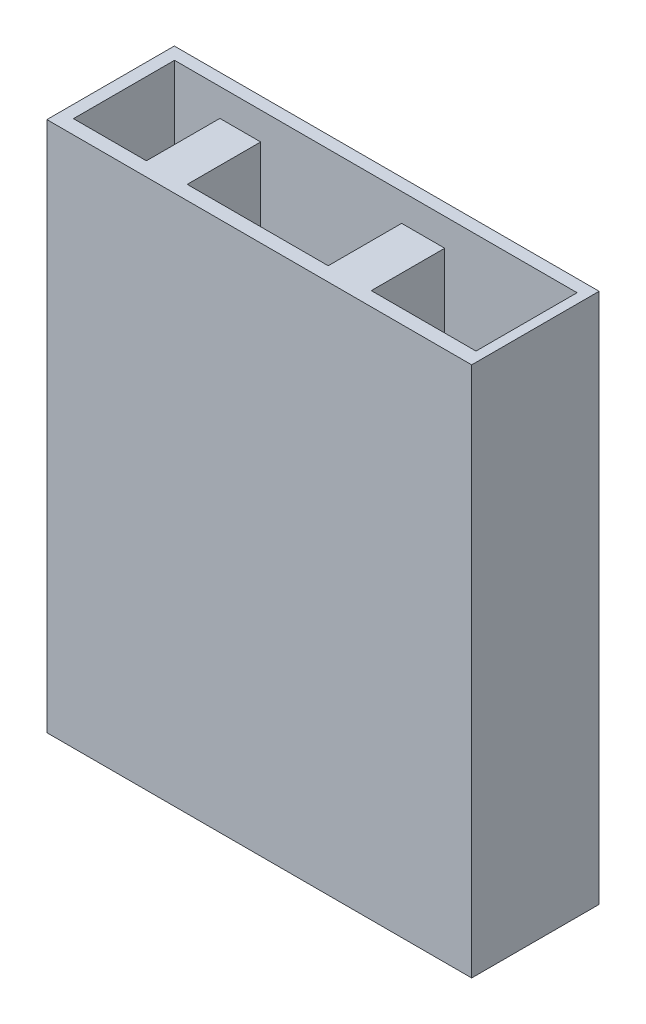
ISO-10303-21;
HEADER;
FILE_DESCRIPTION(('STEP AP214'),'2;1');
FILE_NAME('part.step','',(''),(''),'','','');
FILE_SCHEMA(('AUTOMOTIVE_DESIGN { 1 0 10303 214 1 1 1 1 }'));
ENDSEC;
DATA;
#1=APPLICATION_CONTEXT('core data for automotive mechanical design processes');
#2=APPLICATION_PROTOCOL_DEFINITION('international standard','automotive_design',2000,#1);
#3=PRODUCT_CONTEXT('',#1,'mechanical');
#4=PRODUCT('Part','Part','',(#3));
#5=PRODUCT_RELATED_PRODUCT_CATEGORY('part','',(#4));
#6=PRODUCT_DEFINITION_FORMATION('','',#4);
#7=PRODUCT_DEFINITION_CONTEXT('part definition',#1,'design');
#8=PRODUCT_DEFINITION('design','',#6,#7);
#9=PRODUCT_DEFINITION_SHAPE('','',#8);
#10=(LENGTH_UNIT() NAMED_UNIT(*) SI_UNIT(.MILLI.,.METRE.));
#11=(NAMED_UNIT(*) PLANE_ANGLE_UNIT() SI_UNIT($,.RADIAN.));
#12=(NAMED_UNIT(*) SI_UNIT($,.STERADIAN.) SOLID_ANGLE_UNIT());
#13=UNCERTAINTY_MEASURE_WITH_UNIT(LENGTH_MEASURE(1.E-05),#10,'distance_accuracy_value','');
#14=(GEOMETRIC_REPRESENTATION_CONTEXT(3) GLOBAL_UNCERTAINTY_ASSIGNED_CONTEXT((#13)) GLOBAL_UNIT_ASSIGNED_CONTEXT((#10,
#11,#12)) REPRESENTATION_CONTEXT('',''));
#15=CARTESIAN_POINT('',(0.,0.,0.));
#16=DIRECTION('',(0.,0.,1.));
#17=DIRECTION('',(1.,0.,0.));
#18=AXIS2_PLACEMENT_3D('',#15,#16,#17);
#19=CARTESIAN_POINT('',(0.,5.,0.));
#20=DIRECTION('',(1.,0.,0.));
#21=DIRECTION('',(0.,0.,-1.));
#22=AXIS2_PLACEMENT_3D('',#19,#20,#21);
#23=PLANE('',#22);
#24=DIRECTION('',(0.,0.,1.));
#25=VECTOR('',#24,1.);
#26=CARTESIAN_POINT('',(0.,0.,0.));
#27=LINE('',#26,#25);
#28=CARTESIAN_POINT('',(0.,0.,0.));
#29=VERTEX_POINT('',#28);
#30=CARTESIAN_POINT('',(0.,0.,1.2));
#31=VERTEX_POINT('',#30);
#32=EDGE_CURVE('E226',#29,#31,#27,.T.);
#33=ORIENTED_EDGE('',*,*,#32,.T.);
#34=DIRECTION('',(0.,-1.,0.));
#35=VECTOR('',#34,1.);
#36=CARTESIAN_POINT('',(0.,5.,1.2));
#37=LINE('',#36,#35);
#38=CARTESIAN_POINT('',(0.,5.,1.2));
#39=VERTEX_POINT('',#38);
#40=EDGE_CURVE('E11',#39,#31,#37,.T.);
#41=ORIENTED_EDGE('',*,*,#40,.F.);
#42=DIRECTION('',(0.,0.,1.));
#43=VECTOR('',#42,1.);
#44=CARTESIAN_POINT('',(0.,5.,0.));
#45=LINE('',#44,#43);
#46=CARTESIAN_POINT('',(0.,5.,0.));
#47=VERTEX_POINT('',#46);
#48=EDGE_CURVE('E246',#47,#39,#45,.T.);
#49=ORIENTED_EDGE('',*,*,#48,.F.);
#50=DIRECTION('',(0.,-1.,0.));
#51=VECTOR('',#50,1.);
#52=CARTESIAN_POINT('',(0.,5.,0.));
#53=LINE('',#52,#51);
#54=EDGE_CURVE('E256',#47,#29,#53,.T.);
#55=ORIENTED_EDGE('',*,*,#54,.T.);
#56=EDGE_LOOP('',(#33,#41,#49,#55));
#57=FACE_BOUND('',#56,.T.);
#58=ADVANCED_FACE('F33',(#57),#23,.F.);
#59=CARTESIAN_POINT('',(0.,5.,1.2));
#60=DIRECTION('',(0.,0.,-1.));
#61=DIRECTION('',(-1.,0.,0.));
#62=AXIS2_PLACEMENT_3D('',#59,#60,#61);
#63=PLANE('',#62);
#64=DIRECTION('',(1.,0.,0.));
#65=VECTOR('',#64,1.);
#66=CARTESIAN_POINT('',(0.,0.,1.2));
#67=LINE('',#66,#65);
#68=CARTESIAN_POINT('',(4.,0.,1.2));
#69=VERTEX_POINT('',#68);
#70=EDGE_CURVE('E259',#31,#69,#67,.T.);
#71=ORIENTED_EDGE('',*,*,#70,.T.);
#72=DIRECTION('',(0.,-1.,0.));
#73=VECTOR('',#72,1.);
#74=CARTESIAN_POINT('',(4.,5.,1.2));
#75=LINE('',#74,#73);
#76=CARTESIAN_POINT('',(4.,5.,1.2));
#77=VERTEX_POINT('',#76);
#78=EDGE_CURVE('E40',#77,#69,#75,.T.);
#79=ORIENTED_EDGE('',*,*,#78,.F.);
#80=DIRECTION('',(1.,0.,0.));
#81=VECTOR('',#80,1.);
#82=CARTESIAN_POINT('',(0.,5.,1.2));
#83=LINE('',#82,#81);
#84=EDGE_CURVE('E249',#39,#77,#83,.T.);
#85=ORIENTED_EDGE('',*,*,#84,.F.);
#86=ORIENTED_EDGE('',*,*,#40,.T.);
#87=EDGE_LOOP('',(#71,#79,#85,#86));
#88=FACE_BOUND('',#87,.T.);
#89=ADVANCED_FACE('F287',(#88),#63,.F.);
#90=CARTESIAN_POINT('',(4.,5.,0.));
#91=DIRECTION('',(-1.,0.,0.));
#92=DIRECTION('',(0.,0.,1.));
#93=AXIS2_PLACEMENT_3D('',#90,#91,#92);
#94=PLANE('',#93);
#95=DIRECTION('',(0.,0.,-1.));
#96=VECTOR('',#95,1.);
#97=CARTESIAN_POINT('',(4.,0.,0.));
#98=LINE('',#97,#96);
#99=CARTESIAN_POINT('',(4.,0.,0.));
#100=VERTEX_POINT('',#99);
#101=EDGE_CURVE('E261',#69,#100,#98,.T.);
#102=ORIENTED_EDGE('',*,*,#101,.T.);
#103=DIRECTION('',(0.,-1.,0.));
#104=VECTOR('',#103,1.);
#105=CARTESIAN_POINT('',(4.,5.,0.));
#106=LINE('',#105,#104);
#107=CARTESIAN_POINT('',(4.,5.,0.));
#108=VERTEX_POINT('',#107);
#109=EDGE_CURVE('E266',#108,#100,#106,.T.);
#110=ORIENTED_EDGE('',*,*,#109,.F.);
#111=DIRECTION('',(0.,0.,-1.));
#112=VECTOR('',#111,1.);
#113=CARTESIAN_POINT('',(4.,5.,0.));
#114=LINE('',#113,#112);
#115=EDGE_CURVE('E252',#77,#108,#114,.T.);
#116=ORIENTED_EDGE('',*,*,#115,.F.);
#117=ORIENTED_EDGE('',*,*,#78,.T.);
#118=EDGE_LOOP('',(#102,#110,#116,#117));
#119=FACE_BOUND('',#118,.T.);
#120=ADVANCED_FACE('F273',(#119),#94,.F.);
#121=CARTESIAN_POINT('',(0.,5.,0.));
#122=DIRECTION('',(0.,0.,1.));
#123=DIRECTION('',(1.,0.,0.));
#124=AXIS2_PLACEMENT_3D('',#121,#122,#123);
#125=PLANE('',#124);
#126=DIRECTION('',(-1.,0.,0.));
#127=VECTOR('',#126,1.);
#128=CARTESIAN_POINT('',(0.,0.,0.));
#129=LINE('',#128,#127);
#130=EDGE_CURVE('E250',#100,#29,#129,.T.);
#131=ORIENTED_EDGE('',*,*,#130,.T.);
#132=ORIENTED_EDGE('',*,*,#54,.F.);
#133=DIRECTION('',(-1.,0.,0.));
#134=VECTOR('',#133,1.);
#135=CARTESIAN_POINT('',(0.,5.,0.));
#136=LINE('',#135,#134);
#137=EDGE_CURVE('E254',#108,#47,#136,.T.);
#138=ORIENTED_EDGE('',*,*,#137,.F.);
#139=ORIENTED_EDGE('',*,*,#109,.T.);
#140=EDGE_LOOP('',(#131,#132,#138,#139));
#141=FACE_BOUND('',#140,.T.);
#142=ADVANCED_FACE('F280',(#141),#125,.F.);
#143=CARTESIAN_POINT('',(0.,5.,0.));
#144=DIRECTION('',(0.,1.,0.));
#145=DIRECTION('',(0.,0.,1.));
#146=AXIS2_PLACEMENT_3D('',#143,#144,#145);
#147=PLANE('',#146);
#148=DIRECTION('',(0.,0.,1.));
#149=VECTOR('',#148,1.);
#150=CARTESIAN_POINT('',(0.117551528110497,5.,0.115514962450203));
#151=LINE('',#150,#149);
#152=CARTESIAN_POINT('',(0.117551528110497,5.,0.115514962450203));
#153=VERTEX_POINT('',#152);
#154=CARTESIAN_POINT('',(0.117551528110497,5.,1.06741067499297));
#155=VERTEX_POINT('',#154);
#156=EDGE_CURVE('E47',#153,#155,#151,.T.);
#157=ORIENTED_EDGE('',*,*,#156,.F.);
#158=DIRECTION('',(-1.,0.,0.));
#159=VECTOR('',#158,1.);
#160=CARTESIAN_POINT('',(0.117551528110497,5.,0.115514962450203));
#161=LINE('',#160,#159);
#162=CARTESIAN_POINT('',(3.90806001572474,5.,0.115514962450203));
#163=VERTEX_POINT('',#162);
#164=EDGE_CURVE('E164',#163,#153,#161,.T.);
#165=ORIENTED_EDGE('',*,*,#164,.F.);
#166=DIRECTION('',(0.,0.,-1.));
#167=VECTOR('',#166,1.);
#168=CARTESIAN_POINT('',(3.90806001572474,5.,0.115514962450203));
#169=LINE('',#168,#167);
#170=CARTESIAN_POINT('',(3.90806001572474,5.,1.06741067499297));
#171=VERTEX_POINT('',#170);
#172=EDGE_CURVE('E167',#171,#163,#169,.T.);
#173=ORIENTED_EDGE('',*,*,#172,.F.);
#174=DIRECTION('',(1.,0.,0.));
#175=VECTOR('',#174,1.);
#176=CARTESIAN_POINT('',(2.92201557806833,5.,1.06741067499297));
#177=LINE('',#176,#175);
#178=CARTESIAN_POINT('',(2.92201557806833,5.,1.06741067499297));
#179=VERTEX_POINT('',#178);
#180=EDGE_CURVE('E219',#179,#171,#177,.T.);
#181=ORIENTED_EDGE('',*,*,#180,.F.);
#182=DIRECTION('',(0.,0.,1.));
#183=VECTOR('',#182,1.);
#184=CARTESIAN_POINT('',(2.92201557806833,5.,0.375898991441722));
#185=LINE('',#184,#183);
#186=CARTESIAN_POINT('',(2.92201557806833,5.,0.375898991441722));
#187=VERTEX_POINT('',#186);
#188=EDGE_CURVE('E216',#187,#179,#185,.T.);
#189=ORIENTED_EDGE('',*,*,#188,.F.);
#190=DIRECTION('',(1.,0.,0.));
#191=VECTOR('',#190,1.);
#192=CARTESIAN_POINT('',(2.51649946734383,5.,0.375898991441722));
#193=LINE('',#192,#191);
#194=CARTESIAN_POINT('',(2.51649946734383,5.,0.375898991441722));
#195=VERTEX_POINT('',#194);
#196=EDGE_CURVE('E213',#195,#187,#193,.T.);
#197=ORIENTED_EDGE('',*,*,#196,.F.);
#198=DIRECTION('',(0.,0.,-1.));
#199=VECTOR('',#198,1.);
#200=CARTESIAN_POINT('',(2.51649946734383,5.,0.375898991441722));
#201=LINE('',#200,#199);
#202=CARTESIAN_POINT('',(2.51649946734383,5.,1.06741067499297));
#203=VERTEX_POINT('',#202);
#204=EDGE_CURVE('E210',#203,#195,#201,.T.);
#205=ORIENTED_EDGE('',*,*,#204,.F.);
#206=DIRECTION('',(1.,0.,0.));
#207=VECTOR('',#206,1.);
#208=CARTESIAN_POINT('',(1.18896777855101,5.,1.06741067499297));
#209=LINE('',#208,#207);
#210=CARTESIAN_POINT('',(1.18896777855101,5.,1.06741067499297));
#211=VERTEX_POINT('',#210);
#212=EDGE_CURVE('E207',#211,#203,#209,.T.);
#213=ORIENTED_EDGE('',*,*,#212,.F.);
#214=DIRECTION('',(0.,0.,1.));
#215=VECTOR('',#214,1.);
#216=CARTESIAN_POINT('',(1.18896777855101,5.,0.375898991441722));
#217=LINE('',#216,#215);
#218=CARTESIAN_POINT('',(1.18896777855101,5.,0.375898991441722));
#219=VERTEX_POINT('',#218);
#220=EDGE_CURVE('E204',#219,#211,#217,.T.);
#221=ORIENTED_EDGE('',*,*,#220,.F.);
#222=DIRECTION('',(1.,0.,0.));
#223=VECTOR('',#222,1.);
#224=CARTESIAN_POINT('',(0.804794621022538,5.,0.375898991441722));
#225=LINE('',#224,#223);
#226=CARTESIAN_POINT('',(0.804794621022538,5.,0.375898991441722));
#227=VERTEX_POINT('',#226);
#228=EDGE_CURVE('E201',#227,#219,#225,.T.);
#229=ORIENTED_EDGE('',*,*,#228,.F.);
#230=DIRECTION('',(0.,0.,-1.));
#231=VECTOR('',#230,1.);
#232=CARTESIAN_POINT('',(0.804794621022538,5.,0.375898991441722));
#233=LINE('',#232,#231);
#234=CARTESIAN_POINT('',(0.804794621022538,5.,1.06741067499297));
#235=VERTEX_POINT('',#234);
#236=EDGE_CURVE('E198',#235,#227,#233,.T.);
#237=ORIENTED_EDGE('',*,*,#236,.F.);
#238=DIRECTION('',(1.,0.,0.));
#239=VECTOR('',#238,1.);
#240=CARTESIAN_POINT('',(0.117551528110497,5.,1.06741067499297));
#241=LINE('',#240,#239);
#242=EDGE_CURVE('E196',#155,#235,#241,.T.);
#243=ORIENTED_EDGE('',*,*,#242,.F.);
#244=EDGE_LOOP('',(#157,#165,#173,#181,#189,#197,#205,#213,#221,#229,#237,#243));
#245=FACE_BOUND('',#244,.T.);
#246=ORIENTED_EDGE('',*,*,#48,.T.);
#247=ORIENTED_EDGE('',*,*,#84,.T.);
#248=ORIENTED_EDGE('',*,*,#115,.T.);
#249=ORIENTED_EDGE('',*,*,#137,.T.);
#250=EDGE_LOOP('',(#246,#247,#248,#249));
#251=FACE_BOUND('',#250,.T.);
#252=ADVANCED_FACE('F286',(#245,#251),#147,.T.);
#253=CARTESIAN_POINT('',(0.,0.,0.));
#254=DIRECTION('',(0.,1.,0.));
#255=DIRECTION('',(0.,0.,1.));
#256=AXIS2_PLACEMENT_3D('',#253,#254,#255);
#257=PLANE('',#256);
#258=DIRECTION('',(-1.,0.,0.));
#259=VECTOR('',#258,1.);
#260=CARTESIAN_POINT('',(0.117551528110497,0.,0.115514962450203));
#261=LINE('',#260,#259);
#262=CARTESIAN_POINT('',(3.90806001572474,0.,0.115514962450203));
#263=VERTEX_POINT('',#262);
#264=CARTESIAN_POINT('',(0.117551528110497,0.,0.115514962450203));
#265=VERTEX_POINT('',#264);
#266=EDGE_CURVE('E153',#263,#265,#261,.T.);
#267=ORIENTED_EDGE('',*,*,#266,.T.);
#268=DIRECTION('',(0.,0.,1.));
#269=VECTOR('',#268,1.);
#270=CARTESIAN_POINT('',(0.117551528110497,0.,0.115514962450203));
#271=LINE('',#270,#269);
#272=CARTESIAN_POINT('',(0.117551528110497,0.,1.06741067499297));
#273=VERTEX_POINT('',#272);
#274=EDGE_CURVE('E147',#265,#273,#271,.T.);
#275=ORIENTED_EDGE('',*,*,#274,.T.);
#276=DIRECTION('',(1.,0.,0.));
#277=VECTOR('',#276,1.);
#278=CARTESIAN_POINT('',(0.117551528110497,0.,1.06741067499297));
#279=LINE('',#278,#277);
#280=CARTESIAN_POINT('',(0.804794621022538,0.,1.06741067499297));
#281=VERTEX_POINT('',#280);
#282=EDGE_CURVE('E156',#273,#281,#279,.T.);
#283=ORIENTED_EDGE('',*,*,#282,.T.);
#284=DIRECTION('',(0.,0.,-1.));
#285=VECTOR('',#284,1.);
#286=CARTESIAN_POINT('',(0.804794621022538,0.,0.375898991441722));
#287=LINE('',#286,#285);
#288=CARTESIAN_POINT('',(0.804794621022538,0.,0.375898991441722));
#289=VERTEX_POINT('',#288);
#290=EDGE_CURVE('E55',#281,#289,#287,.T.);
#291=ORIENTED_EDGE('',*,*,#290,.T.);
#292=DIRECTION('',(1.,0.,0.));
#293=VECTOR('',#292,1.);
#294=CARTESIAN_POINT('',(0.804794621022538,0.,0.375898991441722));
#295=LINE('',#294,#293);
#296=CARTESIAN_POINT('',(1.18896777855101,0.,0.375898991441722));
#297=VERTEX_POINT('',#296);
#298=EDGE_CURVE('E171',#289,#297,#295,.T.);
#299=ORIENTED_EDGE('',*,*,#298,.T.);
#300=DIRECTION('',(0.,0.,1.));
#301=VECTOR('',#300,1.);
#302=CARTESIAN_POINT('',(1.18896777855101,0.,0.375898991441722));
#303=LINE('',#302,#301);
#304=CARTESIAN_POINT('',(1.18896777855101,0.,1.06741067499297));
#305=VERTEX_POINT('',#304);
#306=EDGE_CURVE('E174',#297,#305,#303,.T.);
#307=ORIENTED_EDGE('',*,*,#306,.T.);
#308=DIRECTION('',(1.,0.,0.));
#309=VECTOR('',#308,1.);
#310=CARTESIAN_POINT('',(1.18896777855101,0.,1.06741067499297));
#311=LINE('',#310,#309);
#312=CARTESIAN_POINT('',(2.51649946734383,0.,1.06741067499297));
#313=VERTEX_POINT('',#312);
#314=EDGE_CURVE('E177',#305,#313,#311,.T.);
#315=ORIENTED_EDGE('',*,*,#314,.T.);
#316=DIRECTION('',(0.,0.,-1.));
#317=VECTOR('',#316,1.);
#318=CARTESIAN_POINT('',(2.51649946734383,0.,0.375898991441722));
#319=LINE('',#318,#317);
#320=CARTESIAN_POINT('',(2.51649946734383,0.,0.375898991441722));
#321=VERTEX_POINT('',#320);
#322=EDGE_CURVE('E180',#313,#321,#319,.T.);
#323=ORIENTED_EDGE('',*,*,#322,.T.);
#324=DIRECTION('',(1.,0.,0.));
#325=VECTOR('',#324,1.);
#326=CARTESIAN_POINT('',(2.51649946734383,0.,0.375898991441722));
#327=LINE('',#326,#325);
#328=CARTESIAN_POINT('',(2.92201557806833,0.,0.375898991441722));
#329=VERTEX_POINT('',#328);
#330=EDGE_CURVE('E183',#321,#329,#327,.T.);
#331=ORIENTED_EDGE('',*,*,#330,.T.);
#332=DIRECTION('',(0.,0.,1.));
#333=VECTOR('',#332,1.);
#334=CARTESIAN_POINT('',(2.92201557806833,0.,0.375898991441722));
#335=LINE('',#334,#333);
#336=CARTESIAN_POINT('',(2.92201557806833,0.,1.06741067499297));
#337=VERTEX_POINT('',#336);
#338=EDGE_CURVE('E186',#329,#337,#335,.T.);
#339=ORIENTED_EDGE('',*,*,#338,.T.);
#340=DIRECTION('',(1.,0.,0.));
#341=VECTOR('',#340,1.);
#342=CARTESIAN_POINT('',(2.92201557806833,0.,1.06741067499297));
#343=LINE('',#342,#341);
#344=CARTESIAN_POINT('',(3.90806001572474,0.,1.06741067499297));
#345=VERTEX_POINT('',#344);
#346=EDGE_CURVE('E189',#337,#345,#343,.T.);
#347=ORIENTED_EDGE('',*,*,#346,.T.);
#348=DIRECTION('',(0.,0.,-1.));
#349=VECTOR('',#348,1.);
#350=CARTESIAN_POINT('',(3.90806001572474,0.,0.115514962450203));
#351=LINE('',#350,#349);
#352=EDGE_CURVE('E192',#345,#263,#351,.T.);
#353=ORIENTED_EDGE('',*,*,#352,.T.);
#354=EDGE_LOOP('',(#267,#275,#283,#291,#299,#307,#315,#323,#331,#339,#347,#353));
#355=FACE_BOUND('',#354,.T.);
#356=ORIENTED_EDGE('',*,*,#32,.F.);
#357=ORIENTED_EDGE('',*,*,#130,.F.);
#358=ORIENTED_EDGE('',*,*,#101,.F.);
#359=ORIENTED_EDGE('',*,*,#70,.F.);
#360=EDGE_LOOP('',(#356,#357,#358,#359));
#361=FACE_BOUND('',#360,.T.);
#362=ADVANCED_FACE('F160',(#355,#361),#257,.F.);
#363=CARTESIAN_POINT('',(0.117551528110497,0.,0.115514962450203));
#364=DIRECTION('',(-1.,0.,0.));
#365=DIRECTION('',(0.,0.,1.));
#366=AXIS2_PLACEMENT_3D('',#363,#364,#365);
#367=PLANE('',#366);
#368=ORIENTED_EDGE('',*,*,#156,.T.);
#369=DIRECTION('',(0.,1.,0.));
#370=VECTOR('',#369,1.);
#371=CARTESIAN_POINT('',(0.117551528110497,0.,1.06741067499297));
#372=LINE('',#371,#370);
#373=EDGE_CURVE('E143',#273,#155,#372,.T.);
#374=ORIENTED_EDGE('',*,*,#373,.F.);
#375=ORIENTED_EDGE('',*,*,#274,.F.);
#376=DIRECTION('',(0.,1.,0.));
#377=VECTOR('',#376,1.);
#378=CARTESIAN_POINT('',(0.117551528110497,0.,0.115514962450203));
#379=LINE('',#378,#377);
#380=EDGE_CURVE('E224',#265,#153,#379,.T.);
#381=ORIENTED_EDGE('',*,*,#380,.T.);
#382=EDGE_LOOP('',(#368,#374,#375,#381));
#383=FACE_BOUND('',#382,.T.);
#384=ADVANCED_FACE('F145',(#383),#367,.F.);
#385=CARTESIAN_POINT('',(0.117551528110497,0.,0.115514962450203));
#386=DIRECTION('',(0.,0.,-1.));
#387=DIRECTION('',(-1.,0.,0.));
#388=AXIS2_PLACEMENT_3D('',#385,#386,#387);
#389=PLANE('',#388);
#390=ORIENTED_EDGE('',*,*,#164,.T.);
#391=ORIENTED_EDGE('',*,*,#380,.F.);
#392=ORIENTED_EDGE('',*,*,#266,.F.);
#393=DIRECTION('',(0.,1.,0.));
#394=VECTOR('',#393,1.);
#395=CARTESIAN_POINT('',(3.90806001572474,0.,0.115514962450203));
#396=LINE('',#395,#394);
#397=EDGE_CURVE('E227',#263,#163,#396,.T.);
#398=ORIENTED_EDGE('',*,*,#397,.T.);
#399=EDGE_LOOP('',(#390,#391,#392,#398));
#400=FACE_BOUND('',#399,.T.);
#401=ADVANCED_FACE('F304',(#400),#389,.F.);
#402=CARTESIAN_POINT('',(3.90806001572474,0.,0.115514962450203));
#403=DIRECTION('',(1.,0.,0.));
#404=DIRECTION('',(0.,0.,-1.));
#405=AXIS2_PLACEMENT_3D('',#402,#403,#404);
#406=PLANE('',#405);
#407=ORIENTED_EDGE('',*,*,#172,.T.);
#408=ORIENTED_EDGE('',*,*,#397,.F.);
#409=ORIENTED_EDGE('',*,*,#352,.F.);
#410=DIRECTION('',(0.,1.,0.));
#411=VECTOR('',#410,1.);
#412=CARTESIAN_POINT('',(3.90806001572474,0.,1.06741067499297));
#413=LINE('',#412,#411);
#414=EDGE_CURVE('E229',#345,#171,#413,.T.);
#415=ORIENTED_EDGE('',*,*,#414,.T.);
#416=EDGE_LOOP('',(#407,#408,#409,#415));
#417=FACE_BOUND('',#416,.T.);
#418=ADVANCED_FACE('F337',(#417),#406,.F.);
#419=CARTESIAN_POINT('',(2.92201557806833,0.,1.06741067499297));
#420=DIRECTION('',(0.,0.,1.));
#421=DIRECTION('',(1.,0.,0.));
#422=AXIS2_PLACEMENT_3D('',#419,#420,#421);
#423=PLANE('',#422);
#424=ORIENTED_EDGE('',*,*,#180,.T.);
#425=ORIENTED_EDGE('',*,*,#414,.F.);
#426=ORIENTED_EDGE('',*,*,#346,.F.);
#427=DIRECTION('',(0.,1.,0.));
#428=VECTOR('',#427,1.);
#429=CARTESIAN_POINT('',(2.92201557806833,0.,1.06741067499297));
#430=LINE('',#429,#428);
#431=EDGE_CURVE('E231',#337,#179,#430,.T.);
#432=ORIENTED_EDGE('',*,*,#431,.T.);
#433=EDGE_LOOP('',(#424,#425,#426,#432));
#434=FACE_BOUND('',#433,.T.);
#435=ADVANCED_FACE('F333',(#434),#423,.F.);
#436=CARTESIAN_POINT('',(2.92201557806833,0.,0.375898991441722));
#437=DIRECTION('',(-1.,0.,0.));
#438=DIRECTION('',(0.,0.,1.));
#439=AXIS2_PLACEMENT_3D('',#436,#437,#438);
#440=PLANE('',#439);
#441=ORIENTED_EDGE('',*,*,#188,.T.);
#442=ORIENTED_EDGE('',*,*,#431,.F.);
#443=ORIENTED_EDGE('',*,*,#338,.F.);
#444=DIRECTION('',(0.,1.,0.));
#445=VECTOR('',#444,1.);
#446=CARTESIAN_POINT('',(2.92201557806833,0.,0.375898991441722));
#447=LINE('',#446,#445);
#448=EDGE_CURVE('E233',#329,#187,#447,.T.);
#449=ORIENTED_EDGE('',*,*,#448,.T.);
#450=EDGE_LOOP('',(#441,#442,#443,#449));
#451=FACE_BOUND('',#450,.T.);
#452=ADVANCED_FACE('F329',(#451),#440,.F.);
#453=CARTESIAN_POINT('',(2.51649946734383,0.,0.375898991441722));
#454=DIRECTION('',(0.,0.,1.));
#455=DIRECTION('',(1.,0.,0.));
#456=AXIS2_PLACEMENT_3D('',#453,#454,#455);
#457=PLANE('',#456);
#458=ORIENTED_EDGE('',*,*,#196,.T.);
#459=ORIENTED_EDGE('',*,*,#448,.F.);
#460=ORIENTED_EDGE('',*,*,#330,.F.);
#461=DIRECTION('',(0.,1.,0.));
#462=VECTOR('',#461,1.);
#463=CARTESIAN_POINT('',(2.51649946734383,0.,0.375898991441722));
#464=LINE('',#463,#462);
#465=EDGE_CURVE('E235',#321,#195,#464,.T.);
#466=ORIENTED_EDGE('',*,*,#465,.T.);
#467=EDGE_LOOP('',(#458,#459,#460,#466));
#468=FACE_BOUND('',#467,.T.);
#469=ADVANCED_FACE('F325',(#468),#457,.F.);
#470=CARTESIAN_POINT('',(2.51649946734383,0.,0.375898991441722));
#471=DIRECTION('',(1.,0.,0.));
#472=DIRECTION('',(0.,0.,-1.));
#473=AXIS2_PLACEMENT_3D('',#470,#471,#472);
#474=PLANE('',#473);
#475=ORIENTED_EDGE('',*,*,#204,.T.);
#476=ORIENTED_EDGE('',*,*,#465,.F.);
#477=ORIENTED_EDGE('',*,*,#322,.F.);
#478=DIRECTION('',(0.,1.,0.));
#479=VECTOR('',#478,1.);
#480=CARTESIAN_POINT('',(2.51649946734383,0.,1.06741067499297));
#481=LINE('',#480,#479);
#482=EDGE_CURVE('E237',#313,#203,#481,.T.);
#483=ORIENTED_EDGE('',*,*,#482,.T.);
#484=EDGE_LOOP('',(#475,#476,#477,#483));
#485=FACE_BOUND('',#484,.T.);
#486=ADVANCED_FACE('F321',(#485),#474,.F.);
#487=CARTESIAN_POINT('',(1.18896777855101,0.,1.06741067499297));
#488=DIRECTION('',(0.,0.,1.));
#489=DIRECTION('',(1.,0.,0.));
#490=AXIS2_PLACEMENT_3D('',#487,#488,#489);
#491=PLANE('',#490);
#492=ORIENTED_EDGE('',*,*,#212,.T.);
#493=ORIENTED_EDGE('',*,*,#482,.F.);
#494=ORIENTED_EDGE('',*,*,#314,.F.);
#495=DIRECTION('',(0.,1.,0.));
#496=VECTOR('',#495,1.);
#497=CARTESIAN_POINT('',(1.18896777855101,0.,1.06741067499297));
#498=LINE('',#497,#496);
#499=EDGE_CURVE('E239',#305,#211,#498,.T.);
#500=ORIENTED_EDGE('',*,*,#499,.T.);
#501=EDGE_LOOP('',(#492,#493,#494,#500));
#502=FACE_BOUND('',#501,.T.);
#503=ADVANCED_FACE('F317',(#502),#491,.F.);
#504=CARTESIAN_POINT('',(1.18896777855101,0.,0.375898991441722));
#505=DIRECTION('',(-1.,0.,0.));
#506=DIRECTION('',(0.,0.,1.));
#507=AXIS2_PLACEMENT_3D('',#504,#505,#506);
#508=PLANE('',#507);
#509=ORIENTED_EDGE('',*,*,#220,.T.);
#510=ORIENTED_EDGE('',*,*,#499,.F.);
#511=ORIENTED_EDGE('',*,*,#306,.F.);
#512=DIRECTION('',(0.,1.,0.));
#513=VECTOR('',#512,1.);
#514=CARTESIAN_POINT('',(1.18896777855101,0.,0.375898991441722));
#515=LINE('',#514,#513);
#516=EDGE_CURVE('E241',#297,#219,#515,.T.);
#517=ORIENTED_EDGE('',*,*,#516,.T.);
#518=EDGE_LOOP('',(#509,#510,#511,#517));
#519=FACE_BOUND('',#518,.T.);
#520=ADVANCED_FACE('F313',(#519),#508,.F.);
#521=CARTESIAN_POINT('',(0.804794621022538,0.,0.375898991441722));
#522=DIRECTION('',(0.,0.,1.));
#523=DIRECTION('',(1.,0.,0.));
#524=AXIS2_PLACEMENT_3D('',#521,#522,#523);
#525=PLANE('',#524);
#526=ORIENTED_EDGE('',*,*,#228,.T.);
#527=ORIENTED_EDGE('',*,*,#516,.F.);
#528=ORIENTED_EDGE('',*,*,#298,.F.);
#529=DIRECTION('',(0.,1.,0.));
#530=VECTOR('',#529,1.);
#531=CARTESIAN_POINT('',(0.804794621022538,0.,0.375898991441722));
#532=LINE('',#531,#530);
#533=EDGE_CURVE('E243',#289,#227,#532,.T.);
#534=ORIENTED_EDGE('',*,*,#533,.T.);
#535=EDGE_LOOP('',(#526,#527,#528,#534));
#536=FACE_BOUND('',#535,.T.);
#537=ADVANCED_FACE('F310',(#536),#525,.F.);
#538=CARTESIAN_POINT('',(0.804794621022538,0.,0.375898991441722));
#539=DIRECTION('',(1.,0.,0.));
#540=DIRECTION('',(0.,0.,-1.));
#541=AXIS2_PLACEMENT_3D('',#538,#539,#540);
#542=PLANE('',#541);
#543=ORIENTED_EDGE('',*,*,#236,.T.);
#544=ORIENTED_EDGE('',*,*,#533,.F.);
#545=ORIENTED_EDGE('',*,*,#290,.F.);
#546=DIRECTION('',(0.,1.,0.));
#547=VECTOR('',#546,1.);
#548=CARTESIAN_POINT('',(0.804794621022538,0.,1.06741067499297));
#549=LINE('',#548,#547);
#550=EDGE_CURVE('E152',#281,#235,#549,.T.);
#551=ORIENTED_EDGE('',*,*,#550,.T.);
#552=EDGE_LOOP('',(#543,#544,#545,#551));
#553=FACE_BOUND('',#552,.T.);
#554=ADVANCED_FACE('F307',(#553),#542,.F.);
#555=CARTESIAN_POINT('',(0.117551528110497,0.,1.06741067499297));
#556=DIRECTION('',(0.,0.,1.));
#557=DIRECTION('',(1.,0.,0.));
#558=AXIS2_PLACEMENT_3D('',#555,#556,#557);
#559=PLANE('',#558);
#560=ORIENTED_EDGE('',*,*,#242,.T.);
#561=ORIENTED_EDGE('',*,*,#550,.F.);
#562=ORIENTED_EDGE('',*,*,#282,.F.);
#563=ORIENTED_EDGE('',*,*,#373,.T.);
#564=EDGE_LOOP('',(#560,#561,#562,#563));
#565=FACE_BOUND('',#564,.T.);
#566=ADVANCED_FACE('F157',(#565),#559,.F.);
#567=CLOSED_SHELL('',(#58,#89,#120,#142,#252,#362,#384,#401,#418,#435,#452,#469,#486,#503,#520,
#537,#554,#566));
#568=MANIFOLD_SOLID_BREP('B2',#567);
#569=ADVANCED_BREP_SHAPE_REPRESENTATION('',(#18,#568),#14);
#570=SHAPE_DEFINITION_REPRESENTATION(#9,#569);
ENDSEC;
END-ISO-10303-21;
